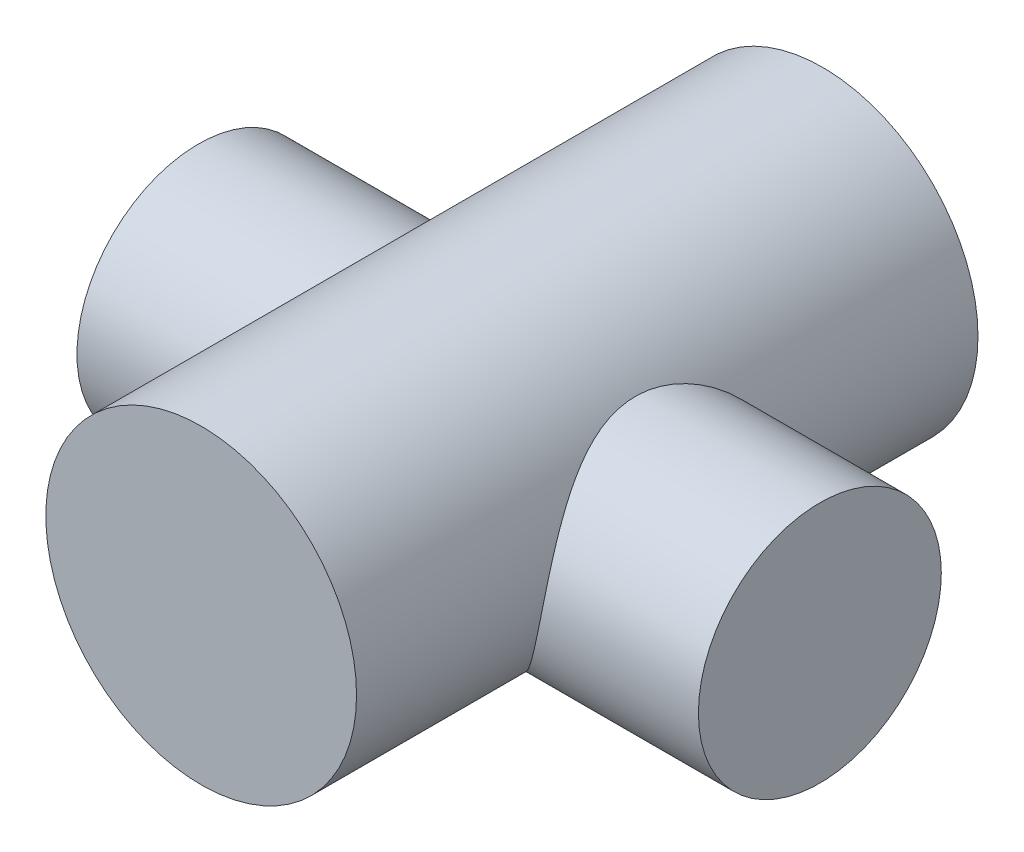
ISO-10303-21;
HEADER;
FILE_DESCRIPTION(('STEP AP214'),'2;1');
FILE_NAME('part.step','',(''),(''),'','','');
FILE_SCHEMA(('AUTOMOTIVE_DESIGN { 1 0 10303 214 1 1 1 1 }'));
ENDSEC;
DATA;
#1=APPLICATION_CONTEXT('core data for automotive mechanical design processes');
#2=APPLICATION_PROTOCOL_DEFINITION('international standard','automotive_design',2000,#1);
#3=PRODUCT_CONTEXT('',#1,'mechanical');
#4=PRODUCT('Part','Part','',(#3));
#5=PRODUCT_RELATED_PRODUCT_CATEGORY('part','',(#4));
#6=PRODUCT_DEFINITION_FORMATION('','',#4);
#7=PRODUCT_DEFINITION_CONTEXT('part definition',#1,'design');
#8=PRODUCT_DEFINITION('design','',#6,#7);
#9=PRODUCT_DEFINITION_SHAPE('','',#8);
#10=(LENGTH_UNIT() NAMED_UNIT(*) SI_UNIT(.MILLI.,.METRE.));
#11=(NAMED_UNIT(*) PLANE_ANGLE_UNIT() SI_UNIT($,.RADIAN.));
#12=(NAMED_UNIT(*) SI_UNIT($,.STERADIAN.) SOLID_ANGLE_UNIT());
#13=UNCERTAINTY_MEASURE_WITH_UNIT(LENGTH_MEASURE(1.E-05),#10,'distance_accuracy_value','');
#14=(GEOMETRIC_REPRESENTATION_CONTEXT(3) GLOBAL_UNCERTAINTY_ASSIGNED_CONTEXT((#13)) GLOBAL_UNIT_ASSIGNED_CONTEXT((#10,
#11,#12)) REPRESENTATION_CONTEXT('',''));
#15=CARTESIAN_POINT('',(0.,0.,0.));
#16=DIRECTION('',(0.,0.,1.));
#17=DIRECTION('',(1.,0.,0.));
#18=AXIS2_PLACEMENT_3D('',#15,#16,#17);
#19=CARTESIAN_POINT('',(0.,0.,40.));
#20=DIRECTION('',(0.,0.,-1.));
#21=DIRECTION('',(-1.,0.,0.));
#22=AXIS2_PLACEMENT_3D('',#19,#20,#21);
#23=CYLINDRICAL_SURFACE('',#22,10.);
#24=CARTESIAN_POINT('',(9.79795897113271,-2.,27.9956105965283));
#25=CARTESIAN_POINT('',(9.75700628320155,-2.20061653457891,27.9956087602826));
#26=CARTESIAN_POINT('',(9.70987258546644,-2.400011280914,27.9878732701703));
#27=CARTESIAN_POINT('',(9.60375656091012,-2.79457525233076,27.9576443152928));
#28=CARTESIAN_POINT('',(9.54476646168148,-2.98974161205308,27.935141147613));
#29=CARTESIAN_POINT('',(9.41556773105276,-3.37466939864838,27.8762631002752));
#30=CARTESIAN_POINT('',(9.3453336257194,-3.5644173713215,27.8398564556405));
#31=CARTESIAN_POINT('',(9.19462434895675,-3.93691306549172,27.7542676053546));
#32=CARTESIAN_POINT('',(9.11414407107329,-4.11965723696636,27.7050790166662));
#33=CARTESIAN_POINT('',(8.94478170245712,-4.47541133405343,27.5956454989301));
#34=CARTESIAN_POINT('',(8.85598951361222,-4.64849900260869,27.5355134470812));
#35=CARTESIAN_POINT('',(8.67029911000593,-4.98629249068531,27.4050058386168));
#36=CARTESIAN_POINT('',(8.57339756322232,-5.15099481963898,27.3346260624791));
#37=CARTESIAN_POINT('',(8.2720798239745,-5.6316476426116,27.1098606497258));
#38=CARTESIAN_POINT('',(8.05684214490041,-5.93457443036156,26.9417119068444));
#39=CARTESIAN_POINT('',(7.65786125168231,-6.43697675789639,26.6196299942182));
#40=CARTESIAN_POINT('',(7.47860947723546,-6.64403077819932,26.4716478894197));
#41=CARTESIAN_POINT('',(7.10976486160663,-7.03731908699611,26.1614937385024));
#42=CARTESIAN_POINT('',(6.92017074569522,-7.22355080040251,25.9993199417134));
#43=CARTESIAN_POINT('',(6.53234347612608,-7.57610669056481,25.662570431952));
#44=CARTESIAN_POINT('',(6.33408714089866,-7.74237233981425,25.4879605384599));
#45=CARTESIAN_POINT('',(5.93143519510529,-8.05499965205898,25.128483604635));
#46=CARTESIAN_POINT('',(5.72704081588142,-8.20136527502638,24.9436186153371));
#47=CARTESIAN_POINT('',(5.30788312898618,-8.47887767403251,24.559241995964));
#48=CARTESIAN_POINT('',(5.09299136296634,-8.60945466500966,24.3594602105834));
#49=CARTESIAN_POINT('',(4.66069812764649,-8.85094456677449,23.9507850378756));
#50=CARTESIAN_POINT('',(4.44329570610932,-8.96184973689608,23.7418881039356));
#51=CARTESIAN_POINT('',(4.0093174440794,-9.16419043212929,23.3153121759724));
#52=CARTESIAN_POINT('',(3.79274099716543,-9.25567977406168,23.0976594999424));
#53=CARTESIAN_POINT('',(3.47159929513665,-9.37876213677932,22.7626366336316));
#54=CARTESIAN_POINT('',(3.36520457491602,-9.41742130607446,22.6495743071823));
#55=CARTESIAN_POINT('',(3.15464459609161,-9.49002608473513,22.4199271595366));
#56=CARTESIAN_POINT('',(3.05047894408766,-9.52397253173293,22.3033429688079));
#57=CARTESIAN_POINT('',(2.83234127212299,-9.59127330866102,22.0499029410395));
#58=CARTESIAN_POINT('',(2.71889925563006,-9.62395289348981,21.9124082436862));
#59=CARTESIAN_POINT('',(2.50069366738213,-9.68293317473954,21.6289921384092));
#60=CARTESIAN_POINT('',(2.39593486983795,-9.70923037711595,21.4830661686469));
#61=CARTESIAN_POINT('',(2.23246420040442,-9.74786957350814,21.2238587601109));
#62=CARTESIAN_POINT('',(2.16930507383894,-9.76203783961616,21.1137137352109));
#63=CARTESIAN_POINT('',(2.05791015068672,-9.78612451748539,20.8856435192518));
#64=CARTESIAN_POINT('',(2.00962789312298,-9.79605619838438,20.7677439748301));
#65=CARTESIAN_POINT('',(1.94803492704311,-9.80845861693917,20.560765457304));
#66=CARTESIAN_POINT('',(1.9285765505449,-9.8122741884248,20.4736625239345));
#67=CARTESIAN_POINT('',(1.90467274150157,-9.81694382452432,20.2973990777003));
#68=CARTESIAN_POINT('',(1.90019718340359,-9.81780383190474,20.2082430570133));
#69=CARTESIAN_POINT('',(1.90708089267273,-9.81646808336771,20.0305627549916));
#70=CARTESIAN_POINT('',(1.91844759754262,-9.81427089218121,19.9420387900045));
#71=CARTESIAN_POINT('',(1.95491523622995,-9.80707106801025,19.7679481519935));
#72=CARTESIAN_POINT('',(1.98004516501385,-9.80206251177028,19.6823881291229));
#73=CARTESIAN_POINT('',(2.06356297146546,-9.78491535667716,19.4515936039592));
#74=CARTESIAN_POINT('',(2.13270183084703,-9.77025185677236,19.3105675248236));
#75=CARTESIAN_POINT('',(2.28789090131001,-9.73508999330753,19.0387797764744));
#76=CARTESIAN_POINT('',(2.37402864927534,-9.71456116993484,18.9080763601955));
#77=CARTESIAN_POINT('',(2.54827185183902,-9.67025259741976,18.6642005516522));
#78=CARTESIAN_POINT('',(2.63568799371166,-9.64685623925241,18.5504581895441));
#79=CARTESIAN_POINT('',(2.81519890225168,-9.59600820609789,18.3276295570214));
#80=CARTESIAN_POINT('',(2.90729618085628,-9.5685543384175,18.2185458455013));
#81=CARTESIAN_POINT('',(3.09450350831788,-9.50966362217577,18.0037549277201));
#82=CARTESIAN_POINT('',(3.18961874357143,-9.47821960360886,17.8980542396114));
#83=CARTESIAN_POINT('',(3.38161937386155,-9.41142913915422,17.6895242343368));
#84=CARTESIAN_POINT('',(3.47850500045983,-9.37608217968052,17.586695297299));
#85=CARTESIAN_POINT('',(3.77124448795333,-9.26398375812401,17.2812125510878));
#86=CARTESIAN_POINT('',(3.96864163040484,-9.18134155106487,17.0821647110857));
#87=CARTESIAN_POINT('',(4.36369977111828,-9.00029992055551,16.6921415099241));
#88=CARTESIAN_POINT('',(4.5613603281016,-8.90191584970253,16.5011585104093));
#89=CARTESIAN_POINT('',(5.00059107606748,-8.66429474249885,16.0832993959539));
#90=CARTESIAN_POINT('',(5.24174269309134,-8.52087194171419,15.8583388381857));
#91=CARTESIAN_POINT('',(5.71857102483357,-8.20848917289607,15.4202999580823));
#92=CARTESIAN_POINT('',(5.9542446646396,-8.0395152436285,15.2072282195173));
#93=CARTESIAN_POINT('',(6.41644194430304,-7.67564030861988,14.7955616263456));
#94=CARTESIAN_POINT('',(6.64299261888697,-7.48082459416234,14.5969223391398));
#95=CARTESIAN_POINT('',(7.08450111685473,-7.06413726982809,14.2162702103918));
#96=CARTESIAN_POINT('',(7.29946657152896,-6.84228379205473,14.0342463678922));
#97=CARTESIAN_POINT('',(7.77466168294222,-6.3022486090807,13.6404284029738));
#98=CARTESIAN_POINT('',(8.03005011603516,-5.97474474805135,13.4352033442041));
#99=CARTESIAN_POINT('',(8.38745905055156,-5.44935613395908,13.1602684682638));
#100=CARTESIAN_POINT('',(8.50230929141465,-5.26855159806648,13.074112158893));
#101=CARTESIAN_POINT('',(8.72226496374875,-4.89579991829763,12.9141971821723));
#102=CARTESIAN_POINT('',(8.82737188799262,-4.70385448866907,12.8404366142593));
#103=CARTESIAN_POINT('',(9.00995222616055,-4.34220516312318,12.7180030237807));
#104=CARTESIAN_POINT('',(9.08912053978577,-4.17407507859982,12.6671983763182));
#105=CARTESIAN_POINT('',(9.2388677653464,-3.83122595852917,12.576337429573));
#106=CARTESIAN_POINT('',(9.30944848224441,-3.65650831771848,12.5362788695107));
#107=CARTESIAN_POINT('',(9.44121921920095,-3.30139803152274,12.467862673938));
#108=CARTESIAN_POINT('',(9.50241301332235,-3.12100770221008,12.439500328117));
#109=CARTESIAN_POINT('',(9.61473984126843,-2.75559563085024,12.3953219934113));
#110=CARTESIAN_POINT('',(9.66587279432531,-2.57057385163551,12.3795061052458));
#111=CARTESIAN_POINT('',(9.7577712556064,-2.19619160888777,12.3610985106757));
#112=CARTESIAN_POINT('',(9.79847621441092,-2.00681246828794,12.3585824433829));
#113=CARTESIAN_POINT('',(9.86876491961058,-1.62631651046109,12.3675137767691));
#114=CARTESIAN_POINT('',(9.8983486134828,-1.43519968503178,12.3789612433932));
#115=CARTESIAN_POINT('',(9.94627317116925,-1.05296956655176,12.4160964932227));
#116=CARTESIAN_POINT('',(9.96461583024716,-0.861856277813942,12.4417820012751));
#117=CARTESIAN_POINT('',(9.99022804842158,-0.481350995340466,12.5073959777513));
#118=CARTESIAN_POINT('',(9.99749828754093,-0.291958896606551,12.5473235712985));
#119=CARTESIAN_POINT('',(10.0012331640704,0.0660411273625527,12.6368086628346));
#120=CARTESIAN_POINT('',(9.99863559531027,0.234950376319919,12.6851328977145));
#121=CARTESIAN_POINT('',(9.98520399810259,0.568887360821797,12.7929508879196));
#122=CARTESIAN_POINT('',(9.97436722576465,0.733913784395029,12.8524483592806));
#123=CARTESIAN_POINT('',(9.94511053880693,1.05896256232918,12.9821125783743));
#124=CARTESIAN_POINT('',(9.92669270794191,1.21898627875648,13.0522763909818));
#125=CARTESIAN_POINT('',(9.88302821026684,1.53327772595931,13.2027674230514));
#126=CARTESIAN_POINT('',(9.85777887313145,1.68754317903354,13.2830986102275));
#127=CARTESIAN_POINT('',(9.79970398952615,1.99802884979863,13.4581078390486));
#128=CARTESIAN_POINT('',(9.76653290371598,2.15387329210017,13.553337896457));
#129=CARTESIAN_POINT('',(9.69455230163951,2.45765168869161,13.7538024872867));
#130=CARTESIAN_POINT('',(9.65574087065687,2.60558293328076,13.859040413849));
#131=CARTESIAN_POINT('',(9.53246654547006,3.03666096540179,14.1887658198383));
#132=CARTESIAN_POINT('',(9.44113812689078,3.3072201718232,14.4273376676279));
#133=CARTESIAN_POINT('',(9.23375791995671,3.85169796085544,14.9780885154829));
#134=CARTESIAN_POINT('',(9.1160858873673,4.11927462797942,15.295938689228));
#135=CARTESIAN_POINT('',(8.94100592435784,4.48067459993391,15.8016119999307));
#136=CARTESIAN_POINT('',(8.88282542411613,4.59457599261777,15.9751776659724));
#137=CARTESIAN_POINT('',(8.76882845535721,4.80856791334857,16.3314810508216));
#138=CARTESIAN_POINT('',(8.71301247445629,4.90865560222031,16.514220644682));
#139=CARTESIAN_POINT('',(8.60046632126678,5.10351529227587,16.9065951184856));
#140=CARTESIAN_POINT('',(8.54418808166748,5.19679153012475,17.1171058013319));
#141=CARTESIAN_POINT('',(8.43964492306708,5.36490418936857,17.5471838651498));
#142=CARTESIAN_POINT('',(8.39137561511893,5.4397507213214,17.766746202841));
#143=CARTESIAN_POINT('',(8.30555104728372,5.56991049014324,18.2131880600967));
#144=CARTESIAN_POINT('',(8.26797524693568,5.62526122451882,18.440052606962));
#145=CARTESIAN_POINT('',(8.20577720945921,5.71561528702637,18.8995314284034));
#146=CARTESIAN_POINT('',(8.18115130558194,5.75062437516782,19.1321440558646));
#147=CARTESIAN_POINT('',(8.14893425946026,5.79616427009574,19.5682437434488));
#148=CARTESIAN_POINT('',(8.13945881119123,5.80940996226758,19.771311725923));
#149=CARTESIAN_POINT('',(8.13188857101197,5.82000336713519,20.1780696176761));
#150=CARTESIAN_POINT('',(8.13379273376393,5.81735254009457,20.3817594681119));
#151=CARTESIAN_POINT('',(8.14887827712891,5.79620095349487,20.7879251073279));
#152=CARTESIAN_POINT('',(8.16206203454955,5.77769685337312,20.9904006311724));
#153=CARTESIAN_POINT('',(8.19899498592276,5.72516423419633,21.3923360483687));
#154=CARTESIAN_POINT('',(8.22274417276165,5.69113572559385,21.5917959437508));
#155=CARTESIAN_POINT('',(8.27648342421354,5.61264782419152,21.9645549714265));
#156=CARTESIAN_POINT('',(8.30550409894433,5.56974058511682,22.138325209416));
#157=CARTESIAN_POINT('',(8.36989950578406,5.47249264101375,22.4814580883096));
#158=CARTESIAN_POINT('',(8.40527623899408,5.4181483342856,22.6508193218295));
#159=CARTESIAN_POINT('',(8.51917467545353,5.23868147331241,23.151140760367));
#160=CARTESIAN_POINT('',(8.60549406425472,5.09708454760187,23.4745276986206));
#161=CARTESIAN_POINT('',(8.80325024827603,4.74854315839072,24.1446103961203));
#162=CARTESIAN_POINT('',(8.91650911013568,4.53491104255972,24.487288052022));
#163=CARTESIAN_POINT('',(9.08673837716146,4.1771675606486,24.9734853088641));
#164=CARTESIAN_POINT('',(9.14358356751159,4.0515892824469,25.1310285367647));
#165=CARTESIAN_POINT('',(9.2557680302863,3.78829979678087,25.4363218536));
#166=CARTESIAN_POINT('',(9.31110702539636,3.65058637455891,25.584070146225));
#167=CARTESIAN_POINT('',(9.42558226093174,3.34490279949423,25.8874806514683));
#168=CARTESIAN_POINT('',(9.48428266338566,3.17532364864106,26.041691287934));
#169=CARTESIAN_POINT('',(9.5953164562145,2.8220839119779,26.3354702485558));
#170=CARTESIAN_POINT('',(9.64765251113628,2.63842927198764,26.4750446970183));
#171=CARTESIAN_POINT('',(9.74371957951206,2.25796618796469,26.7383063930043));
#172=CARTESIAN_POINT('',(9.78745221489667,2.06116023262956,26.8619966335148));
#173=CARTESIAN_POINT('',(9.8641360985,1.65570360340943,27.0920948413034));
#174=CARTESIAN_POINT('',(9.89708980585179,1.44705564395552,27.1985067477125));
#175=CARTESIAN_POINT('',(9.94754379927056,1.04111261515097,27.3829260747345));
#176=CARTESIAN_POINT('',(9.96626222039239,0.844776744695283,27.46271169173));
#177=CARTESIAN_POINT('',(9.99206752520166,0.445600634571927,27.6062456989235));
#178=CARTESIAN_POINT('',(9.9991569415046,0.242761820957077,27.6699975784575));
#179=CARTESIAN_POINT('',(10.0006994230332,-0.166961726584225,27.7806189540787));
#180=CARTESIAN_POINT('',(9.99518498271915,-0.373834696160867,27.8275315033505));
#181=CARTESIAN_POINT('',(9.97093216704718,-0.789851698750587,27.9042678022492));
#182=CARTESIAN_POINT('',(9.95220284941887,-0.998994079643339,27.9341032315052));
#183=CARTESIAN_POINT('',(9.91064736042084,-1.34047704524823,27.968877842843));
#184=CARTESIAN_POINT('',(9.89185046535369,-1.47282138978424,27.9789359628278));
#185=CARTESIAN_POINT('',(9.84890328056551,-1.73695142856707,27.9923021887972));
#186=CARTESIAN_POINT('',(9.82475418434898,-1.86873724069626,27.995611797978));
#187=CARTESIAN_POINT('',(9.79795897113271,-2.,27.9956105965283));
#188=B_SPLINE_CURVE_WITH_KNOTS('',3,(#24,#25,#26,#27,#28,#29,#30,#31,#32,#33,#34,#35,#36,#37,
#38,#39,#40,#41,#42,#43,#44,#45,#46,#47,#48,#49,#50,#51,#52,#53,#54,#55,#56,#57,#58,#59,#60,#61,
#62,#63,#64,#65,#66,#67,#68,#69,#70,#71,#72,#73,#74,#75,#76,#77,#78,#79,#80,#81,#82,#83,#84,#85,
#86,#87,#88,#89,#90,#91,#92,#93,#94,#95,#96,#97,#98,#99,#100,#101,#102,#103,#104,#105,#106,#107,
#108,#109,#110,#111,#112,#113,#114,#115,#116,#117,#118,#119,#120,#121,#122,#123,#124,#125,#126,
#127,#128,#129,#130,#131,#132,#133,#134,#135,#136,#137,#138,#139,#140,#141,#142,#143,#144,#145,
#146,#147,#148,#149,#150,#151,#152,#153,#154,#155,#156,#157,#158,#159,#160,#161,#162,#163,#164,
#165,#166,#167,#168,#169,#170,#171,#172,#173,#174,#175,#176,#177,#178,#179,#180,#181,#182,#183,
#184,#185,#186,#187),.UNSPECIFIED.,.T.,.F.,(4,2,2,2,2,2,2,2,2,2,2,2,2,2,2,2,2,2,2,2,2,2,2,2,2,2,
2,2,2,2,2,2,2,2,2,2,2,2,2,2,2,2,2,2,2,2,2,2,2,2,2,2,2,2,2,2,2,2,2,2,2,2,2,2,2,2,2,2,2,2,2,2,2,2,
2,2,2,2,2,2,2,4),(0.,0.614101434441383,1.22860676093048,1.84452451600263,2.46075044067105,
3.07094755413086,3.68139663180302,4.90081652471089,5.83356533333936,6.76642936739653,
7.701964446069,8.63731308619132,9.5999974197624,10.5630597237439,11.5234166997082,
12.0033013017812,12.4831005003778,13.0264889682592,13.5701742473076,13.9527897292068,
14.3341978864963,14.6010812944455,14.8674277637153,15.1338993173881,15.4009344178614,
15.8714520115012,16.3444589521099,16.7802115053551,17.2162004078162,17.6529841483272,
18.0898254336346,18.965978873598,19.8412829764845,20.9190466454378,21.9974013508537,
23.0722815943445,24.146444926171,25.5306119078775,26.2225988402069,26.9144795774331,
27.4918984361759,28.0691957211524,28.6462602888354,29.2233294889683,29.8036771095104,
30.3840274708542,30.9642851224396,31.5445071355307,32.0710290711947,32.5977264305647,
33.1242791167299,33.651037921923,34.2073455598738,34.7638424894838,35.8763922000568,
37.1663217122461,37.8126042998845,38.459019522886,39.1691348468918,39.8788597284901,
40.5872119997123,41.295363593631,41.9056183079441,42.5158169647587,43.1261442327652,
43.7364710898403,44.2799002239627,44.8235007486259,45.9101211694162,47.163198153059,
47.7907339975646,48.4183846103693,49.1272881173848,49.8358938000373,50.5443657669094,
51.2526759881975,51.8899687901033,52.52712278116,53.1626359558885,53.7977139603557,
54.1996081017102,54.6014127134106),.UNSPECIFIED.);
#189=CARTESIAN_POINT('',(9.79795897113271,-2.,27.9956105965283));
#190=VERTEX_POINT('',#189);
#191=EDGE_CURVE('E39',#190,#190,#188,.T.);
#192=ORIENTED_EDGE('',*,*,#191,.F.);
#193=EDGE_LOOP('',(#192));
#194=FACE_BOUND('',#193,.T.);
#195=CARTESIAN_POINT('',(0.,0.,40.));
#196=DIRECTION('',(0.,0.,1.));
#197=DIRECTION('',(1.,0.,0.));
#198=AXIS2_PLACEMENT_3D('',#195,#196,#197);
#199=CIRCLE('',#198,10.);
#200=CARTESIAN_POINT('',(10.,0.,40.));
#201=VERTEX_POINT('',#200);
#202=EDGE_CURVE('E43',#201,#201,#199,.T.);
#203=ORIENTED_EDGE('',*,*,#202,.F.);
#204=EDGE_LOOP('',(#203));
#205=FACE_BOUND('',#204,.T.);
#206=CARTESIAN_POINT('',(0.,0.,0.));
#207=DIRECTION('',(0.,0.,1.));
#208=DIRECTION('',(1.,0.,0.));
#209=AXIS2_PLACEMENT_3D('',#206,#207,#208);
#210=CIRCLE('',#209,10.);
#211=CARTESIAN_POINT('',(10.,0.,0.));
#212=VERTEX_POINT('',#211);
#213=EDGE_CURVE('E47',#212,#212,#210,.T.);
#214=ORIENTED_EDGE('',*,*,#213,.T.);
#215=EDGE_LOOP('',(#214));
#216=FACE_BOUND('',#215,.T.);
#217=CARTESIAN_POINT('',(-10.,0.,27.7354402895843));
#218=CARTESIAN_POINT('',(-9.99999851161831,0.193990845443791,27.6840991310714));
#219=CARTESIAN_POINT('',(-9.99434030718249,0.386086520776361,27.6252533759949));
#220=CARTESIAN_POINT('',(-9.97252210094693,0.764741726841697,27.4931389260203));
#221=CARTESIAN_POINT('',(-9.95635350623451,0.95129659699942,27.419858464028));
#222=CARTESIAN_POINT('',(-9.91450490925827,1.31784113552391,27.2594346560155));
#223=CARTESIAN_POINT('',(-9.88879933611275,1.49781171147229,27.1722544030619));
#224=CARTESIAN_POINT('',(-9.82908929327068,1.84955561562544,26.9849947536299));
#225=CARTESIAN_POINT('',(-9.79508081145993,2.02132493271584,26.8849091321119));
#226=CARTESIAN_POINT('',(-9.72040211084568,2.35428113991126,26.6736248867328));
#227=CARTESIAN_POINT('',(-9.6797898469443,2.51554437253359,26.5625259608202));
#228=CARTESIAN_POINT('',(-9.59305489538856,2.82837325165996,26.3293508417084));
#229=CARTESIAN_POINT('',(-9.54693008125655,2.97993512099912,26.207270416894));
#230=CARTESIAN_POINT('',(-9.40236197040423,3.41911290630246,25.8257707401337));
#231=CARTESIAN_POINT('',(-9.29764090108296,3.69157307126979,25.5508680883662));
#232=CARTESIAN_POINT('',(-9.13067278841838,4.08091768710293,25.0955217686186));
#233=CARTESIAN_POINT('',(-9.07017476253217,4.21322892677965,24.9272224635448));
#234=CARTESIAN_POINT('',(-8.94953829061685,4.46374874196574,24.5801607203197));
#235=CARTESIAN_POINT('',(-8.88939993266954,4.58195398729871,24.4013958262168));
#236=CARTESIAN_POINT('',(-8.77161323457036,4.80359948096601,24.0341740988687));
#237=CARTESIAN_POINT('',(-8.71396482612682,4.90704013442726,23.8457175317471));
#238=CARTESIAN_POINT('',(-8.60334176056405,5.09850295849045,23.4598227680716));
#239=CARTESIAN_POINT('',(-8.5503661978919,5.18652811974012,23.2623863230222));
#240=CARTESIAN_POINT('',(-8.45788509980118,5.33580724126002,22.8860894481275));
#241=CARTESIAN_POINT('',(-8.41752481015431,5.39906282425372,22.7082322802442));
#242=CARTESIAN_POINT('',(-8.34346376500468,5.51282344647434,22.347205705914));
#243=CARTESIAN_POINT('',(-8.30975977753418,5.56333467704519,22.1640389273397));
#244=CARTESIAN_POINT('',(-8.25036857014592,5.65103775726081,21.7934648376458));
#245=CARTESIAN_POINT('',(-8.22467270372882,5.68824397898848,21.6060623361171));
#246=CARTESIAN_POINT('',(-8.18237911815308,5.74891696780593,21.2280180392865));
#247=CARTESIAN_POINT('',(-8.16578127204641,5.77238392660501,21.0373762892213));
#248=CARTESIAN_POINT('',(-8.14241768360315,5.80529489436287,20.6533844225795));
#249=CARTESIAN_POINT('',(-8.13569776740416,5.81467354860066,20.4600258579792));
#250=CARTESIAN_POINT('',(-8.1325723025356,5.81904421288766,20.073060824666));
#251=CARTESIAN_POINT('',(-8.13616678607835,5.81403617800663,19.8794543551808));
#252=CARTESIAN_POINT('',(-8.15349301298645,5.7897125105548,19.4935181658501));
#253=CARTESIAN_POINT('',(-8.16722941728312,5.77039029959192,19.3011890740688));
#254=CARTESIAN_POINT('',(-8.20417510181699,5.71773896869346,18.9193950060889));
#255=CARTESIAN_POINT('',(-8.22738439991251,5.68440982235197,18.7299300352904));
#256=CARTESIAN_POINT('',(-8.28047845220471,5.60675817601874,18.367030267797));
#257=CARTESIAN_POINT('',(-8.30984691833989,5.56326626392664,18.1933405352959));
#258=CARTESIAN_POINT('',(-8.37489226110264,5.46485590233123,17.8504106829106));
#259=CARTESIAN_POINT('',(-8.4105712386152,5.40993364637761,17.6811720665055));
#260=CARTESIAN_POINT('',(-8.52530243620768,5.22873794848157,17.1812508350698));
#261=CARTESIAN_POINT('',(-8.61207528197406,5.0859993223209,16.8581960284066));
#262=CARTESIAN_POINT('',(-8.81072193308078,4.73474039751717,16.1884231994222));
#263=CARTESIAN_POINT('',(-8.92440189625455,4.51945596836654,15.8457890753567));
#264=CARTESIAN_POINT('',(-9.09502181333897,4.15912792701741,15.35985352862));
#265=CARTESIAN_POINT('',(-9.15195830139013,4.03266646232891,15.20242724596));
#266=CARTESIAN_POINT('',(-9.26423609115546,3.76757610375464,14.8974427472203));
#267=CARTESIAN_POINT('',(-9.31957708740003,3.62894490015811,14.7498864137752));
#268=CARTESIAN_POINT('',(-9.43383892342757,3.32157837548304,14.4472731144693));
#269=CARTESIAN_POINT('',(-9.49231794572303,3.15125771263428,14.2936545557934));
#270=CARTESIAN_POINT('',(-9.60279530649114,2.79656961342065,14.0011335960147));
#271=CARTESIAN_POINT('',(-9.65479660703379,2.61220865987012,13.8622244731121));
#272=CARTESIAN_POINT('',(-9.75006455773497,2.23045209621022,13.6004203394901));
#273=CARTESIAN_POINT('',(-9.79333628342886,2.03306414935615,13.4775160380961));
#274=CARTESIAN_POINT('',(-9.86900117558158,1.62651036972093,13.2490514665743));
#275=CARTESIAN_POINT('',(-9.90139649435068,1.4173468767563,13.143487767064));
#276=CARTESIAN_POINT('',(-9.95062801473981,1.01115408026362,12.9610265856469));
#277=CARTESIAN_POINT('',(-9.96872526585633,0.815101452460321,12.8822947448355));
#278=CARTESIAN_POINT('',(-9.99331187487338,0.416593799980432,12.7407911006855));
#279=CARTESIAN_POINT('',(-9.999801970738,0.214139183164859,12.6780182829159));
#280=CARTESIAN_POINT('',(-10.0001888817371,-0.195009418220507,12.569189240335));
#281=CARTESIAN_POINT('',(-9.99409892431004,-0.401698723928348,12.5231155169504));
#282=CARTESIAN_POINT('',(-9.96871526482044,-0.817337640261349,12.4479900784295));
#283=CARTESIAN_POINT('',(-9.9494234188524,-1.02628692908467,12.4189359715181));
#284=CARTESIAN_POINT('',(-9.90139670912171,-1.41214878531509,12.3810008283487));
#285=CARTESIAN_POINT('',(-9.87455982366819,-1.58906836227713,12.3697122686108));
#286=CARTESIAN_POINT('',(-9.81134106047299,-1.94155571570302,12.3591262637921));
#287=CARTESIAN_POINT('',(-9.7749593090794,-2.11712351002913,12.3598286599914));
#288=CARTESIAN_POINT('',(-9.69292093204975,-2.46563100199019,12.3728269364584));
#289=CARTESIAN_POINT('',(-9.64726428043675,-2.63857069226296,12.3851228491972));
#290=CARTESIAN_POINT('',(-9.54710314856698,-2.98070497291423,12.4207480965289));
#291=CARTESIAN_POINT('',(-9.492598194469,-3.14989936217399,12.4440780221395));
#292=CARTESIAN_POINT('',(-9.37503819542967,-3.48427711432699,12.5012171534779));
#293=CARTESIAN_POINT('',(-9.31194882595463,-3.64944106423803,12.5350691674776));
#294=CARTESIAN_POINT('',(-9.17801704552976,-3.97428257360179,12.6124614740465));
#295=CARTESIAN_POINT('',(-9.10717185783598,-4.13395814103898,12.656005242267));
#296=CARTESIAN_POINT('',(-8.88399234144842,-4.60376516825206,12.7999993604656));
#297=CARTESIAN_POINT('',(-8.72094255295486,-4.90487762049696,12.9138483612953));
#298=CARTESIAN_POINT('',(-8.41660518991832,-5.40587894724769,13.1379369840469));
#299=CARTESIAN_POINT('',(-8.28042294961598,-5.61195521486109,13.2416475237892));
#300=CARTESIAN_POINT('',(-7.99720018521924,-6.00867235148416,13.4631061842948));
#301=CARTESIAN_POINT('',(-7.85015545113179,-6.19930717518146,13.5808597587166));
#302=CARTESIAN_POINT('',(-7.54664179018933,-6.5654347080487,13.8286927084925));
#303=CARTESIAN_POINT('',(-7.39014750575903,-6.74088329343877,13.9588058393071));
#304=CARTESIAN_POINT('',(-7.06970190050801,-7.07623489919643,14.2293602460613));
#305=CARTESIAN_POINT('',(-6.90575072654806,-7.23613822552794,14.3698013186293));
#306=CARTESIAN_POINT('',(-6.50963436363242,-7.59742205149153,14.7135325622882));
#307=CARTESIAN_POINT('',(-6.27477681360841,-7.79211115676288,14.9207716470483));
#308=CARTESIAN_POINT('',(-5.7967642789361,-8.15398227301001,15.3493495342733));
#309=CARTESIAN_POINT('',(-5.55360506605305,-8.32115000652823,15.5706955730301));
#310=CARTESIAN_POINT('',(-5.06289286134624,-8.62848044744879,16.0250239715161));
#311=CARTESIAN_POINT('',(-4.81535532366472,-8.76872304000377,16.2579692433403));
#312=CARTESIAN_POINT('',(-4.31867532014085,-9.023676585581,16.7355196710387));
#313=CARTESIAN_POINT('',(-4.06953387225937,-9.13840235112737,16.9801179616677));
#314=CARTESIAN_POINT('',(-3.65338139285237,-9.31054644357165,17.4031413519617));
#315=CARTESIAN_POINT('',(-3.48539046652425,-9.37459858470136,17.5779410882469));
#316=CARTESIAN_POINT('',(-3.15320392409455,-9.49148376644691,17.9366740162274));
#317=CARTESIAN_POINT('',(-2.98903197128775,-9.54425805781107,18.120649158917));
#318=CARTESIAN_POINT('',(-2.75027871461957,-9.61473026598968,18.4071691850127));
#319=CARTESIAN_POINT('',(-2.67147113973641,-9.63688468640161,18.5050887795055));
#320=CARTESIAN_POINT('',(-2.51836885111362,-9.67802046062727,18.7053100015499));
#321=CARTESIAN_POINT('',(-2.44408035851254,-9.69699750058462,18.807617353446));
#322=CARTESIAN_POINT('',(-2.30349615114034,-9.73134565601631,19.0169845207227));
#323=CARTESIAN_POINT('',(-2.23713869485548,-9.74674564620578,19.1239973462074));
#324=CARTESIAN_POINT('',(-2.1166410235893,-9.77361813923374,19.3450185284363));
#325=CARTESIAN_POINT('',(-2.06246200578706,-9.78510317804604,19.4590031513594));
#326=CARTESIAN_POINT('',(-1.98204926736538,-9.80167755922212,19.6739642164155));
#327=CARTESIAN_POINT('',(-1.95254387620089,-9.80754518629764,19.7735992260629));
#328=CARTESIAN_POINT('',(-1.91265803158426,-9.81540601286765,19.9765173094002));
#329=CARTESIAN_POINT('',(-1.90218125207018,-9.8174187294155,20.0797792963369));
#330=CARTESIAN_POINT('',(-1.9028276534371,-9.81729306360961,20.2866796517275));
#331=CARTESIAN_POINT('',(-1.91404439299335,-9.81513670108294,20.390317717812));
#332=CARTESIAN_POINT('',(-1.95541527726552,-9.80697535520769,20.5938249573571));
#333=CARTESIAN_POINT('',(-1.98566410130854,-9.80095112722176,20.6936726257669));
#334=CARTESIAN_POINT('',(-2.08037171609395,-9.78138050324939,20.9428213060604));
#335=CARTESIAN_POINT('',(-2.15450294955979,-9.76550634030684,21.0881154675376));
#336=CARTESIAN_POINT('',(-2.27824127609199,-9.73711922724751,21.2976442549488));
#337=CARTESIAN_POINT('',(-2.32168732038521,-9.72686652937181,21.3662268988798));
#338=CARTESIAN_POINT('',(-2.41173946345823,-9.7049288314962,21.501056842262));
#339=CARTESIAN_POINT('',(-2.45834445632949,-9.69324433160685,21.5673049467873));
#340=CARTESIAN_POINT('',(-2.59509042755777,-9.65784332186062,21.754289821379));
#341=CARTESIAN_POINT('',(-2.68804376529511,-9.63245629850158,21.8726309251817));
#342=CARTESIAN_POINT('',(-2.87855496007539,-9.57725423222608,22.1045129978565));
#343=CARTESIAN_POINT('',(-2.97611535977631,-9.54743672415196,22.2180512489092));
#344=CARTESIAN_POINT('',(-3.17417140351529,-9.48343221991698,22.4416271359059));
#345=CARTESIAN_POINT('',(-3.27467187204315,-9.44923769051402,22.5516583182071));
#346=CARTESIAN_POINT('',(-3.47733406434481,-9.37655355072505,22.7687401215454));
#347=CARTESIAN_POINT('',(-3.57949600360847,-9.33806337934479,22.8757903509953));
#348=CARTESIAN_POINT('',(-3.88775453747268,-9.21597589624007,23.1936211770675));
#349=CARTESIAN_POINT('',(-4.09521266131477,-9.12589226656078,23.4006299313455));
#350=CARTESIAN_POINT('',(-4.50979613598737,-8.92829903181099,23.8059871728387));
#351=CARTESIAN_POINT('',(-4.71692161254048,-8.82080685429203,24.0043440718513));
#352=CARTESIAN_POINT('',(-5.12789121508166,-8.58837639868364,24.3919455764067));
#353=CARTESIAN_POINT('',(-5.33174590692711,-8.46351872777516,24.5812271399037));
#354=CARTESIAN_POINT('',(-5.73535048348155,-8.19539412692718,24.9511298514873));
#355=CARTESIAN_POINT('',(-5.93509904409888,-8.0521213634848,25.1317482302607));
#356=CARTESIAN_POINT('',(-6.32828710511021,-7.74690899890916,25.4827887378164));
#357=CARTESIAN_POINT('',(-6.52173875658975,-7.58500846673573,25.6532311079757));
#358=CARTESIAN_POINT('',(-6.90090378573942,-7.24174664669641,25.9827115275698));
#359=CARTESIAN_POINT('',(-7.08661944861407,-7.0603911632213,26.1417529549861));
#360=CARTESIAN_POINT('',(-7.41011663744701,-6.7181330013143,26.4142386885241));
#361=CARTESIAN_POINT('',(-7.54974275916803,-6.56099122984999,26.5302224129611));
#362=CARTESIAN_POINT('',(-7.82180360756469,-6.23414699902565,26.7526079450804));
#363=CARTESIAN_POINT('',(-7.95423843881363,-6.06444472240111,26.8590098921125));
#364=CARTESIAN_POINT('',(-8.21054730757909,-5.71263903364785,27.060728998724));
#365=CARTESIAN_POINT('',(-8.33442736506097,-5.53054452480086,27.1560539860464));
#366=CARTESIAN_POINT('',(-8.57231028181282,-5.15412777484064,27.3340812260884));
#367=CARTESIAN_POINT('',(-8.68631506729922,-4.95980793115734,27.4167859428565));
#368=CARTESIAN_POINT('',(-8.88318650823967,-4.59604522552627,27.5540394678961));
#369=CARTESIAN_POINT('',(-8.96794163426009,-4.4285218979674,27.6109726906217));
#370=CARTESIAN_POINT('',(-9.12896594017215,-4.08628498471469,27.7141951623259));
#371=CARTESIAN_POINT('',(-9.20523691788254,-3.91157293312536,27.7604866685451));
#372=CARTESIAN_POINT('',(-9.34846595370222,-3.55569629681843,27.8414239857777));
#373=CARTESIAN_POINT('',(-9.41542260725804,-3.37453074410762,27.8760680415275));
#374=CARTESIAN_POINT('',(-9.53921352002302,-3.00683033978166,27.9327335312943));
#375=CARTESIAN_POINT('',(-9.59604812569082,-2.82029567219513,27.9547553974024));
#376=CARTESIAN_POINT('',(-9.69930932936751,-2.44175551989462,27.9854455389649));
#377=CARTESIAN_POINT('',(-9.74565465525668,-2.24971949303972,27.9940124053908));
#378=CARTESIAN_POINT('',(-9.82689844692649,-1.86308551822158,27.9968018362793));
#379=CARTESIAN_POINT('',(-9.86179485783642,-1.66848711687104,27.9910218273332));
#380=CARTESIAN_POINT('',(-9.91981522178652,-1.27903775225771,27.9647346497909));
#381=CARTESIAN_POINT('',(-9.94296838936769,-1.08418863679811,27.9442643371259));
#382=CARTESIAN_POINT('',(-9.97767555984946,-0.695683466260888,27.888525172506));
#383=CARTESIAN_POINT('',(-9.98923839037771,-0.502026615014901,27.8532676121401));
#384=CARTESIAN_POINT('',(-9.9968062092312,-0.258011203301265,27.799236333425));
#385=CARTESIAN_POINT('',(-9.99800672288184,-0.206230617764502,27.7872146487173));
#386=CARTESIAN_POINT('',(-9.99960374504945,-0.102922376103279,27.7621175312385));
#387=CARTESIAN_POINT('',(-10.0000003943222,-0.0513946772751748,27.7490422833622));
#388=CARTESIAN_POINT('',(-10.,0.,27.7354402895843));
#389=B_SPLINE_CURVE_WITH_KNOTS('',3,(#217,#218,#219,#220,#221,#222,#223,#224,#225,#226,#227,
#228,#229,#230,#231,#232,#233,#234,#235,#236,#237,#238,#239,#240,#241,#242,#243,#244,#245,#246,
#247,#248,#249,#250,#251,#252,#253,#254,#255,#256,#257,#258,#259,#260,#261,#262,#263,#264,#265,
#266,#267,#268,#269,#270,#271,#272,#273,#274,#275,#276,#277,#278,#279,#280,#281,#282,#283,#284,
#285,#286,#287,#288,#289,#290,#291,#292,#293,#294,#295,#296,#297,#298,#299,#300,#301,#302,#303,
#304,#305,#306,#307,#308,#309,#310,#311,#312,#313,#314,#315,#316,#317,#318,#319,#320,#321,#322,
#323,#324,#325,#326,#327,#328,#329,#330,#331,#332,#333,#334,#335,#336,#337,#338,#339,#340,#341,
#342,#343,#344,#345,#346,#347,#348,#349,#350,#351,#352,#353,#354,#355,#356,#357,#358,#359,#360,
#361,#362,#363,#364,#365,#366,#367,#368,#369,#370,#371,#372,#373,#374,#375,#376,#377,#378,#379,
#380,#381,#382,#383,#384,#385,#386,#387,#388),.UNSPECIFIED.,.T.,.F.,(4,2,2,2,2,2,2,2,2,2,2,2,2,
2,2,2,2,2,2,2,2,2,2,2,2,2,2,2,2,2,2,2,2,2,2,2,2,2,2,2,2,2,2,2,2,2,2,2,2,2,2,2,2,2,2,2,2,2,2,2,2,
2,2,2,2,2,2,2,2,2,2,2,2,2,2,2,2,2,2,2,2,2,2,2,2,4),(0.,0.601946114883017,1.20438497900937,
1.80845093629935,2.4128093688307,3.01212489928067,3.61167236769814,4.80950143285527,
5.47636845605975,6.14339260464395,6.81039844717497,7.47727474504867,8.05582274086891,
8.63408912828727,9.21172897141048,9.78936075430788,10.3696639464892,10.949968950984,
11.5305408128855,12.1111137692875,12.6548921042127,13.1988518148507,14.2862582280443,
15.5420747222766,16.1710106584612,16.8000662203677,17.5092433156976,18.2180949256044,
18.9265332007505,19.6348312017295,20.270003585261,20.905135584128,21.539600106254,
22.1739754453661,22.7112254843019,23.2484684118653,23.7857128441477,24.3229860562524,
24.8624743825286,25.4021564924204,26.4808787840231,27.2836085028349,28.0866509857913,
28.8919534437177,29.6972400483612,30.8020188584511,31.9073690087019,33.0093871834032,
34.1107639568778,34.8627216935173,35.618505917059,36.0012698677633,36.3845493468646,
36.7646181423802,37.1434582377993,37.4542451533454,37.7634543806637,38.0740001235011,
38.3861030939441,38.8749085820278,39.1203957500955,39.3657974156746,39.823307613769,
40.2810733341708,40.7396377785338,41.1982621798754,42.1173817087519,43.0355867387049,
43.9496636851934,44.8640309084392,45.7765141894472,46.6887259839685,47.4084233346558,
48.1281102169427,48.8472853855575,49.5663199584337,50.1543258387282,50.7422068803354,
51.3301764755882,51.9181259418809,52.5104858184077,53.1029519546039,53.6939368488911,
54.2844712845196,54.4439749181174,54.6034506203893),.UNSPECIFIED.);
#390=CARTESIAN_POINT('',(-10.,0.,27.7354402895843));
#391=VERTEX_POINT('',#390);
#392=EDGE_CURVE('E10',#391,#391,#389,.T.);
#393=ORIENTED_EDGE('',*,*,#392,.F.);
#394=EDGE_LOOP('',(#393));
#395=FACE_BOUND('',#394,.T.);
#396=ADVANCED_FACE('F29',(#194,#205,#216,#395),#23,.T.);
#397=CARTESIAN_POINT('',(0.,0.,40.));
#398=DIRECTION('',(0.,0.,1.));
#399=DIRECTION('',(1.,0.,0.));
#400=AXIS2_PLACEMENT_3D('',#397,#398,#399);
#401=PLANE('',#400);
#402=ORIENTED_EDGE('',*,*,#202,.T.);
#403=EDGE_LOOP('',(#402));
#404=FACE_BOUND('',#403,.T.);
#405=ADVANCED_FACE('F61',(#404),#401,.T.);
#406=CARTESIAN_POINT('',(0.,0.,0.));
#407=DIRECTION('',(0.,0.,1.));
#408=DIRECTION('',(1.,0.,0.));
#409=AXIS2_PLACEMENT_3D('',#406,#407,#408);
#410=PLANE('',#409);
#411=ORIENTED_EDGE('',*,*,#213,.F.);
#412=EDGE_LOOP('',(#411));
#413=FACE_BOUND('',#412,.T.);
#414=ADVANCED_FACE('F64',(#413),#410,.F.);
#415=CARTESIAN_POINT('',(20.,-2.,20.1782531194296));
#416=DIRECTION('',(1.,0.,0.));
#417=DIRECTION('',(0.,0.,-1.));
#418=AXIS2_PLACEMENT_3D('',#415,#416,#417);
#419=PLANE('',#418);
#420=CARTESIAN_POINT('',(20.,-2.,20.1782531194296));
#421=DIRECTION('',(1.,0.,0.));
#422=DIRECTION('',(0.,0.,-1.));
#423=AXIS2_PLACEMENT_3D('',#420,#421,#422);
#424=CIRCLE('',#423,7.81735747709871);
#425=CARTESIAN_POINT('',(20.,-2.,12.3608956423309));
#426=VERTEX_POINT('',#425);
#427=EDGE_CURVE('E83',#426,#426,#424,.T.);
#428=ORIENTED_EDGE('',*,*,#427,.T.);
#429=EDGE_LOOP('',(#428));
#430=FACE_BOUND('',#429,.T.);
#431=ADVANCED_FACE('F67',(#430),#419,.T.);
#432=CARTESIAN_POINT('',(20.,-2.,20.1782531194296));
#433=DIRECTION('',(-1.,0.,0.));
#434=DIRECTION('',(0.,0.,1.));
#435=AXIS2_PLACEMENT_3D('',#432,#433,#434);
#436=CYLINDRICAL_SURFACE('',#435,7.81735747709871);
#437=ORIENTED_EDGE('',*,*,#427,.F.);
#438=EDGE_LOOP('',(#437));
#439=FACE_BOUND('',#438,.T.);
#440=ORIENTED_EDGE('',*,*,#191,.T.);
#441=EDGE_LOOP('',(#440));
#442=FACE_BOUND('',#441,.T.);
#443=ADVANCED_FACE('F58',(#439,#442),#436,.T.);
#444=CARTESIAN_POINT('',(-20.,-2.,20.1782531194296));
#445=DIRECTION('',(1.,0.,0.));
#446=DIRECTION('',(0.,0.,-1.));
#447=AXIS2_PLACEMENT_3D('',#444,#445,#446);
#448=CIRCLE('',#447,7.81735747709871);
#449=CARTESIAN_POINT('',(-20.,-2.,12.3608956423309));
#450=VERTEX_POINT('',#449);
#451=EDGE_CURVE('E85',#450,#450,#448,.T.);
#452=ORIENTED_EDGE('',*,*,#451,.T.);
#453=EDGE_LOOP('',(#452));
#454=FACE_BOUND('',#453,.T.);
#455=ORIENTED_EDGE('',*,*,#392,.T.);
#456=EDGE_LOOP('',(#455));
#457=FACE_BOUND('',#456,.T.);
#458=ADVANCED_FACE('F52',(#454,#457),#436,.T.);
#459=CARTESIAN_POINT('',(-20.,-2.,20.1782531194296));
#460=DIRECTION('',(1.,0.,0.));
#461=DIRECTION('',(0.,0.,-1.));
#462=AXIS2_PLACEMENT_3D('',#459,#460,#461);
#463=PLANE('',#462);
#464=ORIENTED_EDGE('',*,*,#451,.F.);
#465=EDGE_LOOP('',(#464));
#466=FACE_BOUND('',#465,.T.);
#467=ADVANCED_FACE('F57',(#466),#463,.F.);
#468=CLOSED_SHELL('',(#396,#405,#414,#431,#443,#458,#467));
#469=MANIFOLD_SOLID_BREP('B2',#468);
#470=ADVANCED_BREP_SHAPE_REPRESENTATION('',(#18,#469),#14);
#471=SHAPE_DEFINITION_REPRESENTATION(#9,#470);
ENDSEC;
END-ISO-10303-21;
